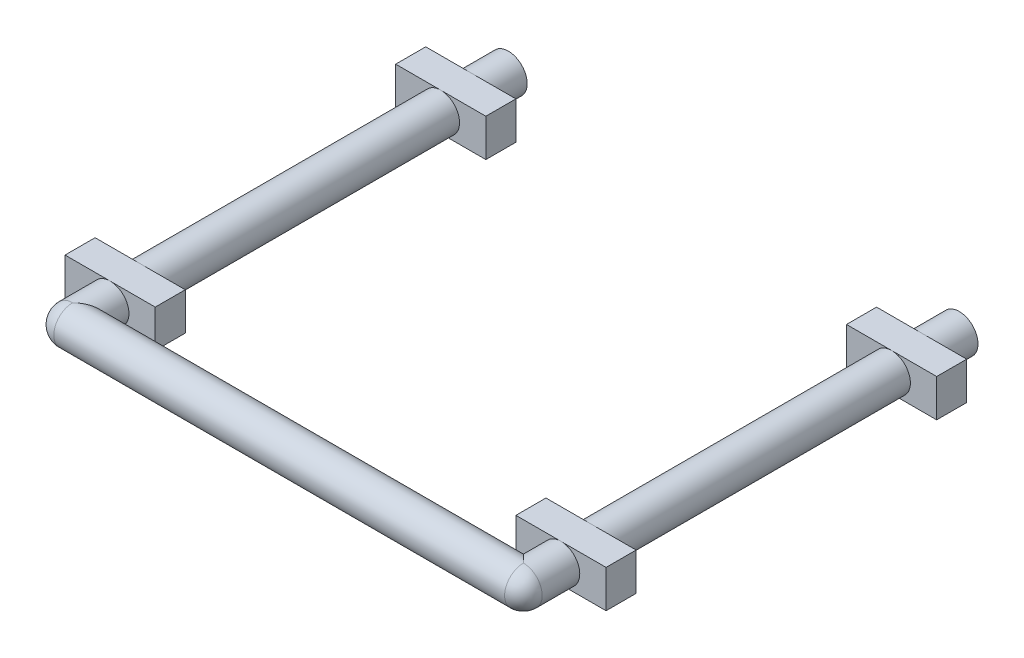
ISO-10303-21;
HEADER;
FILE_DESCRIPTION(('STEP AP214'),'2;1');
FILE_NAME('part.step','',(''),(''),'','','');
FILE_SCHEMA(('AUTOMOTIVE_DESIGN { 1 0 10303 214 1 1 1 1 }'));
ENDSEC;
DATA;
#1=APPLICATION_CONTEXT('core data for automotive mechanical design processes');
#2=APPLICATION_PROTOCOL_DEFINITION('international standard','automotive_design',2000,#1);
#3=PRODUCT_CONTEXT('',#1,'mechanical');
#4=PRODUCT('Part','Part','',(#3));
#5=PRODUCT_RELATED_PRODUCT_CATEGORY('part','',(#4));
#6=PRODUCT_DEFINITION_FORMATION('','',#4);
#7=PRODUCT_DEFINITION_CONTEXT('part definition',#1,'design');
#8=PRODUCT_DEFINITION('design','',#6,#7);
#9=PRODUCT_DEFINITION_SHAPE('','',#8);
#10=(LENGTH_UNIT() NAMED_UNIT(*) SI_UNIT(.MILLI.,.METRE.));
#11=(NAMED_UNIT(*) PLANE_ANGLE_UNIT() SI_UNIT($,.RADIAN.));
#12=(NAMED_UNIT(*) SI_UNIT($,.STERADIAN.) SOLID_ANGLE_UNIT());
#13=UNCERTAINTY_MEASURE_WITH_UNIT(LENGTH_MEASURE(1.E-05),#10,'distance_accuracy_value','');
#14=(GEOMETRIC_REPRESENTATION_CONTEXT(3) GLOBAL_UNCERTAINTY_ASSIGNED_CONTEXT((#13)) GLOBAL_UNIT_ASSIGNED_CONTEXT((#10,
#11,#12)) REPRESENTATION_CONTEXT('',''));
#15=CARTESIAN_POINT('',(0.,0.,0.));
#16=DIRECTION('',(0.,0.,1.));
#17=DIRECTION('',(1.,0.,0.));
#18=AXIS2_PLACEMENT_3D('',#15,#16,#17);
#19=CARTESIAN_POINT('',(-54.,2.49999999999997,5.));
#20=DIRECTION('',(0.,0.,1.));
#21=DIRECTION('',(-1.,0.,0.));
#22=AXIS2_PLACEMENT_3D('',#19,#20,#21);
#23=PLANE('',#22);
#24=CARTESIAN_POINT('',(-60.,0.,5.));
#25=DIRECTION('',(0.,0.,-1.));
#26=DIRECTION('',(-1.,0.,0.));
#27=AXIS2_PLACEMENT_3D('',#24,#25,#26);
#28=CIRCLE('',#27,2.5);
#29=CARTESIAN_POINT('',(-60.,2.5,5.));
#30=VERTEX_POINT('',#29);
#31=CARTESIAN_POINT('',(-60.,-2.5,5.));
#32=VERTEX_POINT('',#31);
#33=EDGE_CURVE('E43',#30,#32,#28,.T.);
#34=ORIENTED_EDGE('',*,*,#33,.F.);
#35=DIRECTION('',(1.,0.,0.));
#36=VECTOR('',#35,1.);
#37=CARTESIAN_POINT('',(-54.,2.49999999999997,5.));
#38=LINE('',#37,#36);
#39=CARTESIAN_POINT('',(-54.,2.49999999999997,5.));
#40=VERTEX_POINT('',#39);
#41=EDGE_CURVE('E211',#30,#40,#38,.T.);
#42=ORIENTED_EDGE('',*,*,#41,.T.);
#43=DIRECTION('',(0.,-1.,0.));
#44=VECTOR('',#43,1.);
#45=CARTESIAN_POINT('',(-54.,2.49999999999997,5.));
#46=LINE('',#45,#44);
#47=CARTESIAN_POINT('',(-54.,-2.49999999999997,5.));
#48=VERTEX_POINT('',#47);
#49=EDGE_CURVE('E221',#40,#48,#46,.T.);
#50=ORIENTED_EDGE('',*,*,#49,.T.);
#51=DIRECTION('',(-1.,0.,0.));
#52=VECTOR('',#51,1.);
#53=CARTESIAN_POINT('',(-54.,-2.49999999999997,5.));
#54=LINE('',#53,#52);
#55=EDGE_CURVE('E225',#48,#32,#54,.T.);
#56=ORIENTED_EDGE('',*,*,#55,.T.);
#57=EDGE_LOOP('',(#34,#42,#50,#56));
#58=FACE_BOUND('',#57,.T.);
#59=ADVANCED_FACE('F32',(#58),#23,.F.);
#60=EDGE_CURVE('E11',#32,#30,#28,.T.);
#61=ORIENTED_EDGE('',*,*,#60,.F.);
#62=CARTESIAN_POINT('',(-66.,-2.5,5.));
#63=VERTEX_POINT('',#62);
#64=EDGE_CURVE('E241',#32,#63,#54,.T.);
#65=ORIENTED_EDGE('',*,*,#64,.T.);
#66=DIRECTION('',(0.,1.,0.));
#67=VECTOR('',#66,1.);
#68=CARTESIAN_POINT('',(-66.0000000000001,2.5,5.));
#69=LINE('',#68,#67);
#70=CARTESIAN_POINT('',(-66.0000000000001,2.5,5.));
#71=VERTEX_POINT('',#70);
#72=EDGE_CURVE('E209',#63,#71,#69,.T.);
#73=ORIENTED_EDGE('',*,*,#72,.T.);
#74=EDGE_CURVE('E205',#71,#30,#38,.T.);
#75=ORIENTED_EDGE('',*,*,#74,.T.);
#76=EDGE_LOOP('',(#61,#65,#73,#75));
#77=FACE_BOUND('',#76,.T.);
#78=ADVANCED_FACE('F207',(#77),#23,.F.);
#79=CARTESIAN_POINT('',(-54.,-2.49999999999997,49.));
#80=DIRECTION('',(0.,0.,1.));
#81=DIRECTION('',(-1.,0.,0.));
#82=AXIS2_PLACEMENT_3D('',#79,#80,#81);
#83=PLANE('',#82);
#84=CARTESIAN_POINT('',(-60.,0.,49.));
#85=DIRECTION('',(0.,0.,-1.));
#86=DIRECTION('',(-1.,0.,0.));
#87=AXIS2_PLACEMENT_3D('',#84,#85,#86);
#88=CIRCLE('',#87,2.5);
#89=CARTESIAN_POINT('',(-60.,2.5,49.));
#90=VERTEX_POINT('',#89);
#91=CARTESIAN_POINT('',(-60.,-2.5,49.));
#92=VERTEX_POINT('',#91);
#93=EDGE_CURVE('E267',#90,#92,#88,.T.);
#94=ORIENTED_EDGE('',*,*,#93,.F.);
#95=DIRECTION('',(1.,0.,0.));
#96=VECTOR('',#95,1.);
#97=CARTESIAN_POINT('',(-54.,2.49999999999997,49.));
#98=LINE('',#97,#96);
#99=CARTESIAN_POINT('',(-54.,2.49999999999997,49.));
#100=VERTEX_POINT('',#99);
#101=EDGE_CURVE('E273',#90,#100,#98,.T.);
#102=ORIENTED_EDGE('',*,*,#101,.T.);
#103=DIRECTION('',(0.,-1.,0.));
#104=VECTOR('',#103,1.);
#105=CARTESIAN_POINT('',(-54.,2.49999999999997,49.));
#106=LINE('',#105,#104);
#107=CARTESIAN_POINT('',(-54.,-2.49999999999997,49.));
#108=VERTEX_POINT('',#107);
#109=EDGE_CURVE('E270',#100,#108,#106,.T.);
#110=ORIENTED_EDGE('',*,*,#109,.T.);
#111=DIRECTION('',(-1.,0.,0.));
#112=VECTOR('',#111,1.);
#113=CARTESIAN_POINT('',(-54.,-2.49999999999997,49.));
#114=LINE('',#113,#112);
#115=EDGE_CURVE('E280',#108,#92,#114,.T.);
#116=ORIENTED_EDGE('',*,*,#115,.T.);
#117=EDGE_LOOP('',(#94,#102,#110,#116));
#118=FACE_BOUND('',#117,.T.);
#119=ADVANCED_FACE('F469',(#118),#83,.F.);
#120=EDGE_CURVE('E41',#92,#90,#88,.T.);
#121=ORIENTED_EDGE('',*,*,#120,.F.);
#122=CARTESIAN_POINT('',(-66.,-2.5,49.));
#123=VERTEX_POINT('',#122);
#124=EDGE_CURVE('E279',#92,#123,#114,.T.);
#125=ORIENTED_EDGE('',*,*,#124,.T.);
#126=DIRECTION('',(0.,1.,0.));
#127=VECTOR('',#126,1.);
#128=CARTESIAN_POINT('',(-66.0000000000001,2.5,49.));
#129=LINE('',#128,#127);
#130=CARTESIAN_POINT('',(-66.0000000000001,2.5,49.));
#131=VERTEX_POINT('',#130);
#132=EDGE_CURVE('E276',#123,#131,#129,.T.);
#133=ORIENTED_EDGE('',*,*,#132,.T.);
#134=EDGE_CURVE('E274',#131,#90,#98,.T.);
#135=ORIENTED_EDGE('',*,*,#134,.T.);
#136=EDGE_LOOP('',(#121,#125,#133,#135));
#137=FACE_BOUND('',#136,.T.);
#138=ADVANCED_FACE('F496',(#137),#83,.F.);
#139=CARTESIAN_POINT('',(-5.99999999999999,-2.50000000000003,53.));
#140=DIRECTION('',(0.,0.,1.));
#141=DIRECTION('',(1.,0.,0.));
#142=AXIS2_PLACEMENT_3D('',#139,#140,#141);
#143=PLANE('',#142);
#144=CARTESIAN_POINT('',(0.,0.,53.));
#145=DIRECTION('',(0.,0.,1.));
#146=DIRECTION('',(1.,0.,0.));
#147=AXIS2_PLACEMENT_3D('',#144,#145,#146);
#148=CIRCLE('',#147,2.5);
#149=CARTESIAN_POINT('',(0.,2.5,53.));
#150=VERTEX_POINT('',#149);
#151=CARTESIAN_POINT('',(0.,-2.50000000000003,53.));
#152=VERTEX_POINT('',#151);
#153=EDGE_CURVE('E321',#150,#152,#148,.T.);
#154=ORIENTED_EDGE('',*,*,#153,.F.);
#155=DIRECTION('',(-1.,0.,0.));
#156=VECTOR('',#155,1.);
#157=CARTESIAN_POINT('',(-6.00000000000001,2.5,53.));
#158=LINE('',#157,#156);
#159=CARTESIAN_POINT('',(-6.00000000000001,2.5,53.));
#160=VERTEX_POINT('',#159);
#161=EDGE_CURVE('E350',#150,#160,#158,.T.);
#162=ORIENTED_EDGE('',*,*,#161,.T.);
#163=DIRECTION('',(0.,-1.,0.));
#164=VECTOR('',#163,1.);
#165=CARTESIAN_POINT('',(-6.00000000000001,2.5,53.));
#166=LINE('',#165,#164);
#167=CARTESIAN_POINT('',(-5.99999999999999,-2.50000000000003,53.));
#168=VERTEX_POINT('',#167);
#169=EDGE_CURVE('E341',#160,#168,#166,.T.);
#170=ORIENTED_EDGE('',*,*,#169,.T.);
#171=DIRECTION('',(1.,0.,0.));
#172=VECTOR('',#171,1.);
#173=CARTESIAN_POINT('',(-5.99999999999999,-2.50000000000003,53.));
#174=LINE('',#173,#172);
#175=EDGE_CURVE('E345',#168,#152,#174,.T.);
#176=ORIENTED_EDGE('',*,*,#175,.T.);
#177=EDGE_LOOP('',(#154,#162,#170,#176));
#178=FACE_BOUND('',#177,.T.);
#179=ADVANCED_FACE('F463',(#178),#143,.T.);
#180=CARTESIAN_POINT('',(-6.00000000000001,2.5,9.));
#181=DIRECTION('',(0.,0.,1.));
#182=DIRECTION('',(1.,0.,0.));
#183=AXIS2_PLACEMENT_3D('',#180,#181,#182);
#184=PLANE('',#183);
#185=CARTESIAN_POINT('',(0.,0.,9.));
#186=DIRECTION('',(0.,0.,1.));
#187=DIRECTION('',(1.,0.,0.));
#188=AXIS2_PLACEMENT_3D('',#185,#186,#187);
#189=CIRCLE('',#188,2.5);
#190=CARTESIAN_POINT('',(0.,2.5,9.));
#191=VERTEX_POINT('',#190);
#192=CARTESIAN_POINT('',(0.,-2.50000000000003,9.));
#193=VERTEX_POINT('',#192);
#194=EDGE_CURVE('E365',#191,#193,#189,.T.);
#195=ORIENTED_EDGE('',*,*,#194,.F.);
#196=DIRECTION('',(-1.,0.,0.));
#197=VECTOR('',#196,1.);
#198=CARTESIAN_POINT('',(-6.00000000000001,2.5,9.));
#199=LINE('',#198,#197);
#200=CARTESIAN_POINT('',(-6.00000000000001,2.5,9.));
#201=VERTEX_POINT('',#200);
#202=EDGE_CURVE('E395',#191,#201,#199,.T.);
#203=ORIENTED_EDGE('',*,*,#202,.T.);
#204=DIRECTION('',(0.,-1.,0.));
#205=VECTOR('',#204,1.);
#206=CARTESIAN_POINT('',(-6.00000000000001,2.5,9.));
#207=LINE('',#206,#205);
#208=CARTESIAN_POINT('',(-5.99999999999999,-2.50000000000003,9.));
#209=VERTEX_POINT('',#208);
#210=EDGE_CURVE('E386',#201,#209,#207,.T.);
#211=ORIENTED_EDGE('',*,*,#210,.T.);
#212=DIRECTION('',(1.,0.,0.));
#213=VECTOR('',#212,1.);
#214=CARTESIAN_POINT('',(-5.99999999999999,-2.50000000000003,9.));
#215=LINE('',#214,#213);
#216=EDGE_CURVE('E390',#209,#193,#215,.T.);
#217=ORIENTED_EDGE('',*,*,#216,.T.);
#218=EDGE_LOOP('',(#195,#203,#211,#217));
#219=FACE_BOUND('',#218,.T.);
#220=ADVANCED_FACE('F446',(#219),#184,.T.);
#221=CARTESIAN_POINT('',(0.,0.,5.));
#222=DIRECTION('',(0.,0.,-1.));
#223=DIRECTION('',(-1.,0.,0.));
#224=AXIS2_PLACEMENT_3D('',#221,#222,#223);
#225=CYLINDRICAL_SURFACE('',#224,2.5);
#226=CARTESIAN_POINT('',(0.,0.,5.));
#227=DIRECTION('',(0.,0.,1.));
#228=DIRECTION('',(1.,0.,0.));
#229=AXIS2_PLACEMENT_3D('',#226,#227,#228);
#230=CIRCLE('',#229,2.5);
#231=CARTESIAN_POINT('',(0.,2.5,5.));
#232=VERTEX_POINT('',#231);
#233=CARTESIAN_POINT('',(0.,-2.50000000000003,5.));
#234=VERTEX_POINT('',#233);
#235=EDGE_CURVE('E413',#232,#234,#230,.T.);
#236=ORIENTED_EDGE('',*,*,#235,.F.);
#237=EDGE_CURVE('E412',#234,#232,#230,.T.);
#238=ORIENTED_EDGE('',*,*,#237,.F.);
#239=EDGE_LOOP('',(#236,#238));
#240=FACE_BOUND('',#239,.T.);
#241=CARTESIAN_POINT('',(0.,0.,0.));
#242=DIRECTION('',(0.,0.,1.));
#243=DIRECTION('',(1.,0.,0.));
#244=AXIS2_PLACEMENT_3D('',#241,#242,#243);
#245=CIRCLE('',#244,2.5);
#246=CARTESIAN_POINT('',(2.5,0.,0.));
#247=VERTEX_POINT('',#246);
#248=EDGE_CURVE('E410',#247,#247,#245,.T.);
#249=ORIENTED_EDGE('',*,*,#248,.T.);
#250=EDGE_LOOP('',(#249));
#251=FACE_BOUND('',#250,.T.);
#252=ADVANCED_FACE('F34',(#240,#251),#225,.T.);
#253=CARTESIAN_POINT('',(0.,0.,0.));
#254=DIRECTION('',(0.,0.,1.));
#255=DIRECTION('',(1.,0.,0.));
#256=AXIS2_PLACEMENT_3D('',#253,#254,#255);
#257=PLANE('',#256);
#258=ORIENTED_EDGE('',*,*,#248,.F.);
#259=EDGE_LOOP('',(#258));
#260=FACE_BOUND('',#259,.T.);
#261=ADVANCED_FACE('F562',(#260),#257,.F.);
#262=CARTESIAN_POINT('',(-6.00000000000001,2.5,5.));
#263=DIRECTION('',(0.,0.,1.));
#264=DIRECTION('',(1.,0.,0.));
#265=AXIS2_PLACEMENT_3D('',#262,#263,#264);
#266=PLANE('',#265);
#267=DIRECTION('',(-1.,0.,0.));
#268=VECTOR('',#267,1.);
#269=CARTESIAN_POINT('',(-6.00000000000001,2.5,5.));
#270=LINE('',#269,#268);
#271=CARTESIAN_POINT('',(-6.00000000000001,2.5,5.));
#272=VERTEX_POINT('',#271);
#273=EDGE_CURVE('E382',#232,#272,#270,.T.);
#274=ORIENTED_EDGE('',*,*,#273,.F.);
#275=ORIENTED_EDGE('',*,*,#235,.T.);
#276=DIRECTION('',(1.,0.,0.));
#277=VECTOR('',#276,1.);
#278=CARTESIAN_POINT('',(-5.99999999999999,-2.50000000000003,5.));
#279=LINE('',#278,#277);
#280=CARTESIAN_POINT('',(-5.99999999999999,-2.50000000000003,5.));
#281=VERTEX_POINT('',#280);
#282=EDGE_CURVE('E377',#281,#234,#279,.T.);
#283=ORIENTED_EDGE('',*,*,#282,.F.);
#284=DIRECTION('',(0.,-1.,0.));
#285=VECTOR('',#284,1.);
#286=CARTESIAN_POINT('',(-6.00000000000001,2.5,5.));
#287=LINE('',#286,#285);
#288=EDGE_CURVE('E373',#272,#281,#287,.T.);
#289=ORIENTED_EDGE('',*,*,#288,.F.);
#290=EDGE_LOOP('',(#274,#275,#283,#289));
#291=FACE_BOUND('',#290,.T.);
#292=ADVANCED_FACE('F426',(#291),#266,.F.);
#293=CARTESIAN_POINT('',(6.,-2.5,5.));
#294=VERTEX_POINT('',#293);
#295=EDGE_CURVE('E376',#234,#294,#279,.T.);
#296=ORIENTED_EDGE('',*,*,#295,.F.);
#297=ORIENTED_EDGE('',*,*,#237,.T.);
#298=CARTESIAN_POINT('',(6.00000000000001,2.5,5.));
#299=VERTEX_POINT('',#298);
#300=EDGE_CURVE('E383',#299,#232,#270,.T.);
#301=ORIENTED_EDGE('',*,*,#300,.F.);
#302=DIRECTION('',(0.,1.,0.));
#303=VECTOR('',#302,1.);
#304=CARTESIAN_POINT('',(6.00000000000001,2.5,5.));
#305=LINE('',#304,#303);
#306=EDGE_CURVE('E380',#294,#299,#305,.T.);
#307=ORIENTED_EDGE('',*,*,#306,.F.);
#308=EDGE_LOOP('',(#296,#297,#301,#307));
#309=FACE_BOUND('',#308,.T.);
#310=ADVANCED_FACE('F422',(#309),#266,.F.);
#311=CARTESIAN_POINT('',(-6.00000000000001,2.5,9.));
#312=DIRECTION('',(1.,0.,0.));
#313=DIRECTION('',(0.,1.,0.));
#314=AXIS2_PLACEMENT_3D('',#311,#312,#313);
#315=PLANE('',#314);
#316=ORIENTED_EDGE('',*,*,#288,.T.);
#317=DIRECTION('',(0.,0.,-1.));
#318=VECTOR('',#317,1.);
#319=CARTESIAN_POINT('',(-5.99999999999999,-2.50000000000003,9.));
#320=LINE('',#319,#318);
#321=EDGE_CURVE('E407',#209,#281,#320,.T.);
#322=ORIENTED_EDGE('',*,*,#321,.F.);
#323=ORIENTED_EDGE('',*,*,#210,.F.);
#324=DIRECTION('',(0.,0.,-1.));
#325=VECTOR('',#324,1.);
#326=CARTESIAN_POINT('',(-6.00000000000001,2.5,9.));
#327=LINE('',#326,#325);
#328=EDGE_CURVE('E398',#201,#272,#327,.T.);
#329=ORIENTED_EDGE('',*,*,#328,.T.);
#330=EDGE_LOOP('',(#316,#322,#323,#329));
#331=FACE_BOUND('',#330,.T.);
#332=ADVANCED_FACE('F443',(#331),#315,.F.);
#333=CARTESIAN_POINT('',(-5.99999999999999,-2.50000000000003,9.));
#334=DIRECTION('',(0.,1.,0.));
#335=DIRECTION('',(-1.,0.,0.));
#336=AXIS2_PLACEMENT_3D('',#333,#334,#335);
#337=PLANE('',#336);
#338=ORIENTED_EDGE('',*,*,#282,.T.);
#339=ORIENTED_EDGE('',*,*,#295,.T.);
#340=DIRECTION('',(0.,0.,-1.));
#341=VECTOR('',#340,1.);
#342=CARTESIAN_POINT('',(6.,-2.5,9.));
#343=LINE('',#342,#341);
#344=CARTESIAN_POINT('',(6.,-2.5,9.));
#345=VERTEX_POINT('',#344);
#346=EDGE_CURVE('E404',#345,#294,#343,.T.);
#347=ORIENTED_EDGE('',*,*,#346,.F.);
#348=EDGE_CURVE('E389',#193,#345,#215,.T.);
#349=ORIENTED_EDGE('',*,*,#348,.F.);
#350=ORIENTED_EDGE('',*,*,#216,.F.);
#351=ORIENTED_EDGE('',*,*,#321,.T.);
#352=EDGE_LOOP('',(#338,#339,#347,#349,#350,#351));
#353=FACE_BOUND('',#352,.T.);
#354=ADVANCED_FACE('F439',(#353),#337,.F.);
#355=CARTESIAN_POINT('',(6.00000000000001,2.5,9.));
#356=DIRECTION('',(-1.,0.,0.));
#357=DIRECTION('',(0.,-1.,0.));
#358=AXIS2_PLACEMENT_3D('',#355,#356,#357);
#359=PLANE('',#358);
#360=ORIENTED_EDGE('',*,*,#306,.T.);
#361=DIRECTION('',(0.,0.,-1.));
#362=VECTOR('',#361,1.);
#363=CARTESIAN_POINT('',(6.00000000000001,2.5,9.));
#364=LINE('',#363,#362);
#365=CARTESIAN_POINT('',(6.00000000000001,2.5,9.));
#366=VERTEX_POINT('',#365);
#367=EDGE_CURVE('E401',#366,#299,#364,.T.);
#368=ORIENTED_EDGE('',*,*,#367,.F.);
#369=DIRECTION('',(0.,1.,0.));
#370=VECTOR('',#369,1.);
#371=CARTESIAN_POINT('',(6.00000000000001,2.5,9.));
#372=LINE('',#371,#370);
#373=EDGE_CURVE('E393',#345,#366,#372,.T.);
#374=ORIENTED_EDGE('',*,*,#373,.F.);
#375=ORIENTED_EDGE('',*,*,#346,.T.);
#376=EDGE_LOOP('',(#360,#368,#374,#375));
#377=FACE_BOUND('',#376,.T.);
#378=ADVANCED_FACE('F435',(#377),#359,.F.);
#379=CARTESIAN_POINT('',(-6.00000000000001,2.5,9.));
#380=DIRECTION('',(0.,-1.,0.));
#381=DIRECTION('',(0.,0.,-1.));
#382=AXIS2_PLACEMENT_3D('',#379,#380,#381);
#383=PLANE('',#382);
#384=ORIENTED_EDGE('',*,*,#300,.T.);
#385=ORIENTED_EDGE('',*,*,#273,.T.);
#386=ORIENTED_EDGE('',*,*,#328,.F.);
#387=ORIENTED_EDGE('',*,*,#202,.F.);
#388=EDGE_CURVE('E396',#366,#191,#199,.T.);
#389=ORIENTED_EDGE('',*,*,#388,.F.);
#390=ORIENTED_EDGE('',*,*,#367,.T.);
#391=EDGE_LOOP('',(#384,#385,#386,#387,#389,#390));
#392=FACE_BOUND('',#391,.T.);
#393=ADVANCED_FACE('F429',(#392),#383,.F.);
#394=EDGE_CURVE('E369',#193,#191,#189,.T.);
#395=ORIENTED_EDGE('',*,*,#394,.F.);
#396=ORIENTED_EDGE('',*,*,#348,.T.);
#397=ORIENTED_EDGE('',*,*,#373,.T.);
#398=ORIENTED_EDGE('',*,*,#388,.T.);
#399=EDGE_LOOP('',(#395,#396,#397,#398));
#400=FACE_BOUND('',#399,.T.);
#401=ADVANCED_FACE('F451',(#400),#184,.T.);
#402=CARTESIAN_POINT('',(0.,0.,49.));
#403=DIRECTION('',(0.,0.,-1.));
#404=DIRECTION('',(-1.,0.,0.));
#405=AXIS2_PLACEMENT_3D('',#402,#403,#404);
#406=CYLINDRICAL_SURFACE('',#405,2.5);
#407=ORIENTED_EDGE('',*,*,#194,.T.);
#408=ORIENTED_EDGE('',*,*,#394,.T.);
#409=EDGE_LOOP('',(#407,#408));
#410=FACE_BOUND('',#409,.T.);
#411=CARTESIAN_POINT('',(0.,0.,49.));
#412=DIRECTION('',(0.,0.,1.));
#413=DIRECTION('',(1.,0.,0.));
#414=AXIS2_PLACEMENT_3D('',#411,#412,#413);
#415=CIRCLE('',#414,2.5);
#416=CARTESIAN_POINT('',(0.,2.5,49.));
#417=VERTEX_POINT('',#416);
#418=CARTESIAN_POINT('',(0.,-2.50000000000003,49.));
#419=VERTEX_POINT('',#418);
#420=EDGE_CURVE('E370',#417,#419,#415,.T.);
#421=ORIENTED_EDGE('',*,*,#420,.F.);
#422=EDGE_CURVE('E368',#419,#417,#415,.T.);
#423=ORIENTED_EDGE('',*,*,#422,.F.);
#424=EDGE_LOOP('',(#421,#423));
#425=FACE_BOUND('',#424,.T.);
#426=ADVANCED_FACE('F448',(#410,#425),#406,.T.);
#427=CARTESIAN_POINT('',(-5.99999999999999,-2.50000000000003,49.));
#428=DIRECTION('',(0.,0.,1.));
#429=DIRECTION('',(1.,0.,0.));
#430=AXIS2_PLACEMENT_3D('',#427,#428,#429);
#431=PLANE('',#430);
#432=DIRECTION('',(-1.,0.,0.));
#433=VECTOR('',#432,1.);
#434=CARTESIAN_POINT('',(-6.00000000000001,2.5,49.));
#435=LINE('',#434,#433);
#436=CARTESIAN_POINT('',(-6.00000000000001,2.5,49.));
#437=VERTEX_POINT('',#436);
#438=EDGE_CURVE('E337',#417,#437,#435,.T.);
#439=ORIENTED_EDGE('',*,*,#438,.F.);
#440=ORIENTED_EDGE('',*,*,#420,.T.);
#441=DIRECTION('',(1.,0.,0.));
#442=VECTOR('',#441,1.);
#443=CARTESIAN_POINT('',(-5.99999999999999,-2.50000000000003,49.));
#444=LINE('',#443,#442);
#445=CARTESIAN_POINT('',(-5.99999999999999,-2.50000000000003,49.));
#446=VERTEX_POINT('',#445);
#447=EDGE_CURVE('E332',#446,#419,#444,.T.);
#448=ORIENTED_EDGE('',*,*,#447,.F.);
#449=DIRECTION('',(0.,-1.,0.));
#450=VECTOR('',#449,1.);
#451=CARTESIAN_POINT('',(-6.00000000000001,2.5,49.));
#452=LINE('',#451,#450);
#453=EDGE_CURVE('E328',#437,#446,#452,.T.);
#454=ORIENTED_EDGE('',*,*,#453,.F.);
#455=EDGE_LOOP('',(#439,#440,#448,#454));
#456=FACE_BOUND('',#455,.T.);
#457=ADVANCED_FACE('F458',(#456),#431,.F.);
#458=CARTESIAN_POINT('',(6.,-2.5,49.));
#459=VERTEX_POINT('',#458);
#460=EDGE_CURVE('E331',#419,#459,#444,.T.);
#461=ORIENTED_EDGE('',*,*,#460,.F.);
#462=ORIENTED_EDGE('',*,*,#422,.T.);
#463=CARTESIAN_POINT('',(6.00000000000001,2.5,49.));
#464=VERTEX_POINT('',#463);
#465=EDGE_CURVE('E338',#464,#417,#435,.T.);
#466=ORIENTED_EDGE('',*,*,#465,.F.);
#467=DIRECTION('',(0.,1.,0.));
#468=VECTOR('',#467,1.);
#469=CARTESIAN_POINT('',(6.00000000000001,2.5,49.));
#470=LINE('',#469,#468);
#471=EDGE_CURVE('E335',#459,#464,#470,.T.);
#472=ORIENTED_EDGE('',*,*,#471,.F.);
#473=EDGE_LOOP('',(#461,#462,#466,#472));
#474=FACE_BOUND('',#473,.T.);
#475=ADVANCED_FACE('F541',(#474),#431,.F.);
#476=CARTESIAN_POINT('',(-6.00000000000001,2.5,53.));
#477=DIRECTION('',(1.,0.,0.));
#478=DIRECTION('',(0.,0.,-1.));
#479=AXIS2_PLACEMENT_3D('',#476,#477,#478);
#480=PLANE('',#479);
#481=ORIENTED_EDGE('',*,*,#453,.T.);
#482=DIRECTION('',(0.,0.,-1.));
#483=VECTOR('',#482,1.);
#484=CARTESIAN_POINT('',(-5.99999999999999,-2.50000000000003,53.));
#485=LINE('',#484,#483);
#486=EDGE_CURVE('E362',#168,#446,#485,.T.);
#487=ORIENTED_EDGE('',*,*,#486,.F.);
#488=ORIENTED_EDGE('',*,*,#169,.F.);
#489=DIRECTION('',(0.,0.,-1.));
#490=VECTOR('',#489,1.);
#491=CARTESIAN_POINT('',(-6.00000000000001,2.5,53.));
#492=LINE('',#491,#490);
#493=EDGE_CURVE('E353',#160,#437,#492,.T.);
#494=ORIENTED_EDGE('',*,*,#493,.T.);
#495=EDGE_LOOP('',(#481,#487,#488,#494));
#496=FACE_BOUND('',#495,.T.);
#497=ADVANCED_FACE('F557',(#496),#480,.F.);
#498=CARTESIAN_POINT('',(-5.99999999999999,-2.50000000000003,53.));
#499=DIRECTION('',(0.,1.,0.));
#500=DIRECTION('',(0.,0.,1.));
#501=AXIS2_PLACEMENT_3D('',#498,#499,#500);
#502=PLANE('',#501);
#503=ORIENTED_EDGE('',*,*,#447,.T.);
#504=ORIENTED_EDGE('',*,*,#460,.T.);
#505=DIRECTION('',(0.,0.,-1.));
#506=VECTOR('',#505,1.);
#507=CARTESIAN_POINT('',(6.,-2.5,53.));
#508=LINE('',#507,#506);
#509=CARTESIAN_POINT('',(6.,-2.5,53.));
#510=VERTEX_POINT('',#509);
#511=EDGE_CURVE('E359',#510,#459,#508,.T.);
#512=ORIENTED_EDGE('',*,*,#511,.F.);
#513=EDGE_CURVE('E344',#152,#510,#174,.T.);
#514=ORIENTED_EDGE('',*,*,#513,.F.);
#515=ORIENTED_EDGE('',*,*,#175,.F.);
#516=ORIENTED_EDGE('',*,*,#486,.T.);
#517=EDGE_LOOP('',(#503,#504,#512,#514,#515,#516));
#518=FACE_BOUND('',#517,.T.);
#519=ADVANCED_FACE('F553',(#518),#502,.F.);
#520=CARTESIAN_POINT('',(6.00000000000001,2.5,53.));
#521=DIRECTION('',(-1.,0.,0.));
#522=DIRECTION('',(0.,0.,1.));
#523=AXIS2_PLACEMENT_3D('',#520,#521,#522);
#524=PLANE('',#523);
#525=ORIENTED_EDGE('',*,*,#471,.T.);
#526=DIRECTION('',(0.,0.,-1.));
#527=VECTOR('',#526,1.);
#528=CARTESIAN_POINT('',(6.00000000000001,2.5,53.));
#529=LINE('',#528,#527);
#530=CARTESIAN_POINT('',(6.00000000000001,2.5,53.));
#531=VERTEX_POINT('',#530);
#532=EDGE_CURVE('E356',#531,#464,#529,.T.);
#533=ORIENTED_EDGE('',*,*,#532,.F.);
#534=DIRECTION('',(0.,1.,0.));
#535=VECTOR('',#534,1.);
#536=CARTESIAN_POINT('',(6.00000000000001,2.5,53.));
#537=LINE('',#536,#535);
#538=EDGE_CURVE('E348',#510,#531,#537,.T.);
#539=ORIENTED_EDGE('',*,*,#538,.F.);
#540=ORIENTED_EDGE('',*,*,#511,.T.);
#541=EDGE_LOOP('',(#525,#533,#539,#540));
#542=FACE_BOUND('',#541,.T.);
#543=ADVANCED_FACE('F549',(#542),#524,.F.);
#544=CARTESIAN_POINT('',(-6.00000000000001,2.5,53.));
#545=DIRECTION('',(0.,-1.,0.));
#546=DIRECTION('',(0.,0.,-1.));
#547=AXIS2_PLACEMENT_3D('',#544,#545,#546);
#548=PLANE('',#547);
#549=ORIENTED_EDGE('',*,*,#465,.T.);
#550=ORIENTED_EDGE('',*,*,#438,.T.);
#551=ORIENTED_EDGE('',*,*,#493,.F.);
#552=ORIENTED_EDGE('',*,*,#161,.F.);
#553=EDGE_CURVE('E351',#531,#150,#158,.T.);
#554=ORIENTED_EDGE('',*,*,#553,.F.);
#555=ORIENTED_EDGE('',*,*,#532,.T.);
#556=EDGE_LOOP('',(#549,#550,#551,#552,#554,#555));
#557=FACE_BOUND('',#556,.T.);
#558=ADVANCED_FACE('F545',(#557),#548,.F.);
#559=EDGE_CURVE('E325',#152,#150,#148,.T.);
#560=ORIENTED_EDGE('',*,*,#559,.F.);
#561=ORIENTED_EDGE('',*,*,#513,.T.);
#562=ORIENTED_EDGE('',*,*,#538,.T.);
#563=ORIENTED_EDGE('',*,*,#553,.T.);
#564=EDGE_LOOP('',(#560,#561,#562,#563));
#565=FACE_BOUND('',#564,.T.);
#566=ADVANCED_FACE('F537',(#565),#143,.T.);
#567=CARTESIAN_POINT('',(0.,0.,58.));
#568=DIRECTION('',(0.,0.,-1.));
#569=DIRECTION('',(-1.,0.,0.));
#570=AXIS2_PLACEMENT_3D('',#567,#568,#569);
#571=CYLINDRICAL_SURFACE('',#570,2.5);
#572=ORIENTED_EDGE('',*,*,#153,.T.);
#573=ORIENTED_EDGE('',*,*,#559,.T.);
#574=EDGE_LOOP('',(#572,#573));
#575=FACE_BOUND('',#574,.T.);
#576=CARTESIAN_POINT('',(0.,0.,58.));
#577=DIRECTION('',(0.,0.,1.));
#578=DIRECTION('',(1.,0.,0.));
#579=AXIS2_PLACEMENT_3D('',#576,#577,#578);
#580=CIRCLE('',#579,2.5);
#581=CARTESIAN_POINT('',(0.,-2.50000000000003,58.));
#582=VERTEX_POINT('',#581);
#583=CARTESIAN_POINT('',(0.,2.5,58.));
#584=VERTEX_POINT('',#583);
#585=EDGE_CURVE('E324',#582,#584,#580,.T.);
#586=ORIENTED_EDGE('',*,*,#585,.F.);
#587=CARTESIAN_POINT('',(0.,0.,58.));
#588=DIRECTION('',(0.707106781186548,0.,-0.707106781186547));
#589=DIRECTION('',(-0.707106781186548,0.,-0.707106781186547));
#590=AXIS2_PLACEMENT_3D('',#587,#588,#589);
#591=ELLIPSE('',#590,3.53553390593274,2.5);
#592=EDGE_CURVE('E319',#582,#584,#591,.T.);
#593=ORIENTED_EDGE('',*,*,#592,.T.);
#594=EDGE_LOOP('',(#586,#593));
#595=FACE_BOUND('',#594,.T.);
#596=ADVANCED_FACE('F533',(#575,#595),#571,.T.);
#597=CARTESIAN_POINT('',(-30.,0.,58.));
#598=DIRECTION('',(1.,0.,0.));
#599=DIRECTION('',(0.,0.,-1.));
#600=AXIS2_PLACEMENT_3D('',#597,#598,#599);
#601=CYLINDRICAL_SURFACE('',#600,2.50000000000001);
#602=CARTESIAN_POINT('',(-60.,0.,58.));
#603=DIRECTION('',(0.707106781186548,0.,0.707106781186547));
#604=DIRECTION('',(0.707106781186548,0.,-0.707106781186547));
#605=AXIS2_PLACEMENT_3D('',#602,#603,#604);
#606=ELLIPSE('',#605,3.53553390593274,2.5);
#607=CARTESIAN_POINT('',(-60.,2.5,58.));
#608=VERTEX_POINT('',#607);
#609=CARTESIAN_POINT('',(-60.,-2.5,58.));
#610=VERTEX_POINT('',#609);
#611=EDGE_CURVE('E311',#608,#610,#606,.F.);
#612=ORIENTED_EDGE('',*,*,#611,.F.);
#613=CARTESIAN_POINT('',(-60.,0.,58.));
#614=DIRECTION('',(-1.,0.,0.));
#615=DIRECTION('',(0.,0.,1.));
#616=AXIS2_PLACEMENT_3D('',#613,#614,#615);
#617=CIRCLE('',#616,2.5);
#618=EDGE_CURVE('E313',#608,#610,#617,.F.);
#619=ORIENTED_EDGE('',*,*,#618,.T.);
#620=EDGE_LOOP('',(#612,#619));
#621=FACE_BOUND('',#620,.T.);
#622=ORIENTED_EDGE('',*,*,#592,.F.);
#623=CARTESIAN_POINT('',(0.,0.,58.));
#624=DIRECTION('',(1.,0.,0.));
#625=DIRECTION('',(0.,0.,-1.));
#626=AXIS2_PLACEMENT_3D('',#623,#624,#625);
#627=CIRCLE('',#626,2.50000000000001);
#628=EDGE_CURVE('E316',#584,#582,#627,.T.);
#629=ORIENTED_EDGE('',*,*,#628,.F.);
#630=EDGE_LOOP('',(#622,#629));
#631=FACE_BOUND('',#630,.T.);
#632=ADVANCED_FACE('F529',(#621,#631),#601,.T.);
#633=CARTESIAN_POINT('',(0.,0.,58.));
#634=DIRECTION('',(0.,1.,0.));
#635=DIRECTION('',(1.,0.,0.));
#636=AXIS2_PLACEMENT_3D('',#633,#634,#635);
#637=SPHERICAL_SURFACE('',#636,2.5);
#638=ORIENTED_EDGE('',*,*,#585,.T.);
#639=ORIENTED_EDGE('',*,*,#628,.T.);
#640=EDGE_LOOP('',(#638,#639));
#641=FACE_BOUND('',#640,.T.);
#642=ADVANCED_FACE('F525',(#641),#637,.T.);
#643=CARTESIAN_POINT('',(-60.,0.,58.));
#644=DIRECTION('',(0.,1.,0.));
#645=DIRECTION('',(-1.,0.,0.));
#646=AXIS2_PLACEMENT_3D('',#643,#644,#645);
#647=SPHERICAL_SURFACE('',#646,2.5);
#648=ORIENTED_EDGE('',*,*,#618,.F.);
#649=CARTESIAN_POINT('',(-60.,0.,58.));
#650=DIRECTION('',(0.,0.,1.));
#651=DIRECTION('',(1.,0.,0.));
#652=AXIS2_PLACEMENT_3D('',#649,#650,#651);
#653=CIRCLE('',#652,2.5);
#654=EDGE_CURVE('E36',#608,#610,#653,.T.);
#655=ORIENTED_EDGE('',*,*,#654,.T.);
#656=EDGE_LOOP('',(#648,#655));
#657=FACE_BOUND('',#656,.T.);
#658=ADVANCED_FACE('F521',(#657),#647,.T.);
#659=CARTESIAN_POINT('',(-60.,0.,58.));
#660=DIRECTION('',(0.,0.,-1.));
#661=DIRECTION('',(-1.,0.,0.));
#662=AXIS2_PLACEMENT_3D('',#659,#660,#661);
#663=CYLINDRICAL_SURFACE('',#662,2.5);
#664=CARTESIAN_POINT('',(-60.,0.,53.));
#665=DIRECTION('',(0.,0.,-1.));
#666=DIRECTION('',(-1.,0.,0.));
#667=AXIS2_PLACEMENT_3D('',#664,#665,#666);
#668=CIRCLE('',#667,2.5);
#669=CARTESIAN_POINT('',(-60.,2.5,53.));
#670=VERTEX_POINT('',#669);
#671=CARTESIAN_POINT('',(-60.,-2.5,53.));
#672=VERTEX_POINT('',#671);
#673=EDGE_CURVE('E308',#670,#672,#668,.T.);
#674=ORIENTED_EDGE('',*,*,#673,.F.);
#675=EDGE_CURVE('E307',#672,#670,#668,.T.);
#676=ORIENTED_EDGE('',*,*,#675,.F.);
#677=EDGE_LOOP('',(#674,#676));
#678=FACE_BOUND('',#677,.T.);
#679=ORIENTED_EDGE('',*,*,#654,.F.);
#680=ORIENTED_EDGE('',*,*,#611,.T.);
#681=EDGE_LOOP('',(#679,#680));
#682=FACE_BOUND('',#681,.T.);
#683=ADVANCED_FACE('F518',(#678,#682),#663,.T.);
#684=CARTESIAN_POINT('',(-54.,-2.49999999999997,53.));
#685=DIRECTION('',(0.,0.,1.));
#686=DIRECTION('',(-1.,0.,0.));
#687=AXIS2_PLACEMENT_3D('',#684,#685,#686);
#688=PLANE('',#687);
#689=DIRECTION('',(1.,0.,0.));
#690=VECTOR('',#689,1.);
#691=CARTESIAN_POINT('',(-54.,2.49999999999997,53.));
#692=LINE('',#691,#690);
#693=CARTESIAN_POINT('',(-54.,2.49999999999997,53.));
#694=VERTEX_POINT('',#693);
#695=EDGE_CURVE('E286',#670,#694,#692,.T.);
#696=ORIENTED_EDGE('',*,*,#695,.F.);
#697=ORIENTED_EDGE('',*,*,#673,.T.);
#698=DIRECTION('',(-1.,0.,0.));
#699=VECTOR('',#698,1.);
#700=CARTESIAN_POINT('',(-54.,-2.49999999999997,53.));
#701=LINE('',#700,#699);
#702=CARTESIAN_POINT('',(-54.,-2.49999999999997,53.));
#703=VERTEX_POINT('',#702);
#704=EDGE_CURVE('E294',#703,#672,#701,.T.);
#705=ORIENTED_EDGE('',*,*,#704,.F.);
#706=DIRECTION('',(0.,-1.,0.));
#707=VECTOR('',#706,1.);
#708=CARTESIAN_POINT('',(-54.,2.49999999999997,53.));
#709=LINE('',#708,#707);
#710=EDGE_CURVE('E283',#694,#703,#709,.T.);
#711=ORIENTED_EDGE('',*,*,#710,.F.);
#712=EDGE_LOOP('',(#696,#697,#705,#711));
#713=FACE_BOUND('',#712,.T.);
#714=ADVANCED_FACE('F502',(#713),#688,.T.);
#715=CARTESIAN_POINT('',(-54.,2.49999999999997,53.));
#716=DIRECTION('',(1.,0.,0.));
#717=DIRECTION('',(0.,0.,-1.));
#718=AXIS2_PLACEMENT_3D('',#715,#716,#717);
#719=PLANE('',#718);
#720=ORIENTED_EDGE('',*,*,#109,.F.);
#721=DIRECTION('',(0.,0.,-1.));
#722=VECTOR('',#721,1.);
#723=CARTESIAN_POINT('',(-54.,2.49999999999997,53.));
#724=LINE('',#723,#722);
#725=EDGE_CURVE('E304',#694,#100,#724,.T.);
#726=ORIENTED_EDGE('',*,*,#725,.F.);
#727=ORIENTED_EDGE('',*,*,#710,.T.);
#728=DIRECTION('',(0.,0.,-1.));
#729=VECTOR('',#728,1.);
#730=CARTESIAN_POINT('',(-54.,-2.49999999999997,53.));
#731=LINE('',#730,#729);
#732=EDGE_CURVE('E297',#703,#108,#731,.T.);
#733=ORIENTED_EDGE('',*,*,#732,.T.);
#734=EDGE_LOOP('',(#720,#726,#727,#733));
#735=FACE_BOUND('',#734,.T.);
#736=ADVANCED_FACE('F513',(#735),#719,.T.);
#737=CARTESIAN_POINT('',(-54.,2.49999999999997,53.));
#738=DIRECTION('',(0.,1.,0.));
#739=DIRECTION('',(0.,0.,1.));
#740=AXIS2_PLACEMENT_3D('',#737,#738,#739);
#741=PLANE('',#740);
#742=ORIENTED_EDGE('',*,*,#134,.F.);
#743=DIRECTION('',(0.,0.,-1.));
#744=VECTOR('',#743,1.);
#745=CARTESIAN_POINT('',(-66.0000000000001,2.5,53.));
#746=LINE('',#745,#744);
#747=CARTESIAN_POINT('',(-66.0000000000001,2.5,53.));
#748=VERTEX_POINT('',#747);
#749=EDGE_CURVE('E302',#748,#131,#746,.T.);
#750=ORIENTED_EDGE('',*,*,#749,.F.);
#751=EDGE_CURVE('E287',#748,#670,#692,.T.);
#752=ORIENTED_EDGE('',*,*,#751,.T.);
#753=ORIENTED_EDGE('',*,*,#695,.T.);
#754=ORIENTED_EDGE('',*,*,#725,.T.);
#755=ORIENTED_EDGE('',*,*,#101,.F.);
#756=EDGE_LOOP('',(#742,#750,#752,#753,#754,#755));
#757=FACE_BOUND('',#756,.T.);
#758=ADVANCED_FACE('F509',(#757),#741,.T.);
#759=CARTESIAN_POINT('',(-66.0000000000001,2.5,53.));
#760=DIRECTION('',(-1.,0.,0.));
#761=DIRECTION('',(0.,0.,1.));
#762=AXIS2_PLACEMENT_3D('',#759,#760,#761);
#763=PLANE('',#762);
#764=ORIENTED_EDGE('',*,*,#132,.F.);
#765=DIRECTION('',(0.,0.,-1.));
#766=VECTOR('',#765,1.);
#767=CARTESIAN_POINT('',(-66.,-2.5,53.));
#768=LINE('',#767,#766);
#769=CARTESIAN_POINT('',(-66.,-2.5,53.));
#770=VERTEX_POINT('',#769);
#771=EDGE_CURVE('E299',#770,#123,#768,.T.);
#772=ORIENTED_EDGE('',*,*,#771,.F.);
#773=DIRECTION('',(0.,1.,0.));
#774=VECTOR('',#773,1.);
#775=CARTESIAN_POINT('',(-66.0000000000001,2.5,53.));
#776=LINE('',#775,#774);
#777=EDGE_CURVE('E290',#770,#748,#776,.T.);
#778=ORIENTED_EDGE('',*,*,#777,.T.);
#779=ORIENTED_EDGE('',*,*,#749,.T.);
#780=EDGE_LOOP('',(#764,#772,#778,#779));
#781=FACE_BOUND('',#780,.T.);
#782=ADVANCED_FACE('F505',(#781),#763,.T.);
#783=CARTESIAN_POINT('',(-54.,-2.49999999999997,53.));
#784=DIRECTION('',(0.,-1.,0.));
#785=DIRECTION('',(0.,0.,-1.));
#786=AXIS2_PLACEMENT_3D('',#783,#784,#785);
#787=PLANE('',#786);
#788=ORIENTED_EDGE('',*,*,#115,.F.);
#789=ORIENTED_EDGE('',*,*,#732,.F.);
#790=ORIENTED_EDGE('',*,*,#704,.T.);
#791=EDGE_CURVE('E293',#672,#770,#701,.T.);
#792=ORIENTED_EDGE('',*,*,#791,.T.);
#793=ORIENTED_EDGE('',*,*,#771,.T.);
#794=ORIENTED_EDGE('',*,*,#124,.F.);
#795=EDGE_LOOP('',(#788,#789,#790,#792,#793,#794));
#796=FACE_BOUND('',#795,.T.);
#797=ADVANCED_FACE('F500',(#796),#787,.T.);
#798=ORIENTED_EDGE('',*,*,#791,.F.);
#799=ORIENTED_EDGE('',*,*,#675,.T.);
#800=ORIENTED_EDGE('',*,*,#751,.F.);
#801=ORIENTED_EDGE('',*,*,#777,.F.);
#802=EDGE_LOOP('',(#798,#799,#800,#801));
#803=FACE_BOUND('',#802,.T.);
#804=ADVANCED_FACE('F493',(#803),#688,.T.);
#805=CARTESIAN_POINT('',(-60.,0.,49.));
#806=DIRECTION('',(0.,0.,-1.));
#807=DIRECTION('',(-1.,0.,0.));
#808=AXIS2_PLACEMENT_3D('',#805,#806,#807);
#809=CYLINDRICAL_SURFACE('',#808,2.5);
#810=CARTESIAN_POINT('',(-60.,0.,9.));
#811=DIRECTION('',(0.,0.,-1.));
#812=DIRECTION('',(-1.,0.,0.));
#813=AXIS2_PLACEMENT_3D('',#810,#811,#812);
#814=CIRCLE('',#813,2.5);
#815=CARTESIAN_POINT('',(-60.,2.5,9.));
#816=VERTEX_POINT('',#815);
#817=CARTESIAN_POINT('',(-60.,-2.5,9.));
#818=VERTEX_POINT('',#817);
#819=EDGE_CURVE('E265',#816,#818,#814,.T.);
#820=ORIENTED_EDGE('',*,*,#819,.F.);
#821=EDGE_CURVE('E55',#818,#816,#814,.T.);
#822=ORIENTED_EDGE('',*,*,#821,.F.);
#823=EDGE_LOOP('',(#820,#822));
#824=FACE_BOUND('',#823,.T.);
#825=ORIENTED_EDGE('',*,*,#93,.T.);
#826=ORIENTED_EDGE('',*,*,#120,.T.);
#827=EDGE_LOOP('',(#825,#826));
#828=FACE_BOUND('',#827,.T.);
#829=ADVANCED_FACE('F490',(#824,#828),#809,.T.);
#830=CARTESIAN_POINT('',(-54.,2.49999999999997,9.));
#831=DIRECTION('',(0.,0.,1.));
#832=DIRECTION('',(-1.,0.,0.));
#833=AXIS2_PLACEMENT_3D('',#830,#831,#832);
#834=PLANE('',#833);
#835=DIRECTION('',(1.,0.,0.));
#836=VECTOR('',#835,1.);
#837=CARTESIAN_POINT('',(-54.,2.49999999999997,9.));
#838=LINE('',#837,#836);
#839=CARTESIAN_POINT('',(-54.,2.49999999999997,9.));
#840=VERTEX_POINT('',#839);
#841=EDGE_CURVE('E246',#816,#840,#838,.T.);
#842=ORIENTED_EDGE('',*,*,#841,.F.);
#843=ORIENTED_EDGE('',*,*,#819,.T.);
#844=DIRECTION('',(-1.,0.,0.));
#845=VECTOR('',#844,1.);
#846=CARTESIAN_POINT('',(-54.,-2.49999999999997,9.));
#847=LINE('',#846,#845);
#848=CARTESIAN_POINT('',(-54.,-2.49999999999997,9.));
#849=VERTEX_POINT('',#848);
#850=EDGE_CURVE('E254',#849,#818,#847,.T.);
#851=ORIENTED_EDGE('',*,*,#850,.F.);
#852=DIRECTION('',(0.,-1.,0.));
#853=VECTOR('',#852,1.);
#854=CARTESIAN_POINT('',(-54.,2.49999999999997,9.));
#855=LINE('',#854,#853);
#856=EDGE_CURVE('E243',#840,#849,#855,.T.);
#857=ORIENTED_EDGE('',*,*,#856,.F.);
#858=EDGE_LOOP('',(#842,#843,#851,#857));
#859=FACE_BOUND('',#858,.T.);
#860=ADVANCED_FACE('F476',(#859),#834,.T.);
#861=CARTESIAN_POINT('',(-54.,2.49999999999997,9.));
#862=DIRECTION('',(1.,0.,0.));
#863=DIRECTION('',(0.,1.,0.));
#864=AXIS2_PLACEMENT_3D('',#861,#862,#863);
#865=PLANE('',#864);
#866=ORIENTED_EDGE('',*,*,#49,.F.);
#867=DIRECTION('',(0.,0.,-1.));
#868=VECTOR('',#867,1.);
#869=CARTESIAN_POINT('',(-54.,2.49999999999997,9.));
#870=LINE('',#869,#868);
#871=EDGE_CURVE('E217',#840,#40,#870,.T.);
#872=ORIENTED_EDGE('',*,*,#871,.F.);
#873=ORIENTED_EDGE('',*,*,#856,.T.);
#874=DIRECTION('',(0.,0.,-1.));
#875=VECTOR('',#874,1.);
#876=CARTESIAN_POINT('',(-54.,-2.49999999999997,9.));
#877=LINE('',#876,#875);
#878=EDGE_CURVE('E257',#849,#48,#877,.T.);
#879=ORIENTED_EDGE('',*,*,#878,.T.);
#880=EDGE_LOOP('',(#866,#872,#873,#879));
#881=FACE_BOUND('',#880,.T.);
#882=ADVANCED_FACE('F486',(#881),#865,.T.);
#883=CARTESIAN_POINT('',(-54.,2.49999999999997,9.));
#884=DIRECTION('',(0.,1.,0.));
#885=DIRECTION('',(0.,0.,1.));
#886=AXIS2_PLACEMENT_3D('',#883,#884,#885);
#887=PLANE('',#886);
#888=ORIENTED_EDGE('',*,*,#74,.F.);
#889=DIRECTION('',(0.,0.,-1.));
#890=VECTOR('',#889,1.);
#891=CARTESIAN_POINT('',(-66.0000000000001,2.5,9.));
#892=LINE('',#891,#890);
#893=CARTESIAN_POINT('',(-66.0000000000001,2.5,9.));
#894=VERTEX_POINT('',#893);
#895=EDGE_CURVE('E262',#894,#71,#892,.T.);
#896=ORIENTED_EDGE('',*,*,#895,.F.);
#897=EDGE_CURVE('E247',#894,#816,#838,.T.);
#898=ORIENTED_EDGE('',*,*,#897,.T.);
#899=ORIENTED_EDGE('',*,*,#841,.T.);
#900=ORIENTED_EDGE('',*,*,#871,.T.);
#901=ORIENTED_EDGE('',*,*,#41,.F.);
#902=EDGE_LOOP('',(#888,#896,#898,#899,#900,#901));
#903=FACE_BOUND('',#902,.T.);
#904=ADVANCED_FACE('F215',(#903),#887,.T.);
#905=CARTESIAN_POINT('',(-66.0000000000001,2.5,9.));
#906=DIRECTION('',(-1.,0.,0.));
#907=DIRECTION('',(0.,-1.,0.));
#908=AXIS2_PLACEMENT_3D('',#905,#906,#907);
#909=PLANE('',#908);
#910=ORIENTED_EDGE('',*,*,#72,.F.);
#911=DIRECTION('',(0.,0.,-1.));
#912=VECTOR('',#911,1.);
#913=CARTESIAN_POINT('',(-66.,-2.5,9.));
#914=LINE('',#913,#912);
#915=CARTESIAN_POINT('',(-66.,-2.5,9.));
#916=VERTEX_POINT('',#915);
#917=EDGE_CURVE('E259',#916,#63,#914,.T.);
#918=ORIENTED_EDGE('',*,*,#917,.F.);
#919=DIRECTION('',(0.,1.,0.));
#920=VECTOR('',#919,1.);
#921=CARTESIAN_POINT('',(-66.0000000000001,2.5,9.));
#922=LINE('',#921,#920);
#923=EDGE_CURVE('E250',#916,#894,#922,.T.);
#924=ORIENTED_EDGE('',*,*,#923,.T.);
#925=ORIENTED_EDGE('',*,*,#895,.T.);
#926=EDGE_LOOP('',(#910,#918,#924,#925));
#927=FACE_BOUND('',#926,.T.);
#928=ADVANCED_FACE('F479',(#927),#909,.T.);
#929=CARTESIAN_POINT('',(-54.,-2.49999999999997,9.));
#930=DIRECTION('',(0.,-1.,0.));
#931=DIRECTION('',(1.,0.,0.));
#932=AXIS2_PLACEMENT_3D('',#929,#930,#931);
#933=PLANE('',#932);
#934=ORIENTED_EDGE('',*,*,#55,.F.);
#935=ORIENTED_EDGE('',*,*,#878,.F.);
#936=ORIENTED_EDGE('',*,*,#850,.T.);
#937=EDGE_CURVE('E253',#818,#916,#847,.T.);
#938=ORIENTED_EDGE('',*,*,#937,.T.);
#939=ORIENTED_EDGE('',*,*,#917,.T.);
#940=ORIENTED_EDGE('',*,*,#64,.F.);
#941=EDGE_LOOP('',(#934,#935,#936,#938,#939,#940));
#942=FACE_BOUND('',#941,.T.);
#943=ADVANCED_FACE('F474',(#942),#933,.T.);
#944=ORIENTED_EDGE('',*,*,#937,.F.);
#945=ORIENTED_EDGE('',*,*,#821,.T.);
#946=ORIENTED_EDGE('',*,*,#897,.F.);
#947=ORIENTED_EDGE('',*,*,#923,.F.);
#948=EDGE_LOOP('',(#944,#945,#946,#947));
#949=FACE_BOUND('',#948,.T.);
#950=ADVANCED_FACE('F232',(#949),#834,.T.);
#951=CARTESIAN_POINT('',(-60.,0.,5.));
#952=DIRECTION('',(0.,0.,-1.));
#953=DIRECTION('',(-1.,0.,0.));
#954=AXIS2_PLACEMENT_3D('',#951,#952,#953);
#955=CYLINDRICAL_SURFACE('',#954,2.5);
#956=ORIENTED_EDGE('',*,*,#33,.T.);
#957=ORIENTED_EDGE('',*,*,#60,.T.);
#958=EDGE_LOOP('',(#956,#957));
#959=FACE_BOUND('',#958,.T.);
#960=CARTESIAN_POINT('',(-60.,0.,0.));
#961=DIRECTION('',(0.,0.,-1.));
#962=DIRECTION('',(-1.,0.,0.));
#963=AXIS2_PLACEMENT_3D('',#960,#961,#962);
#964=CIRCLE('',#963,2.5);
#965=CARTESIAN_POINT('',(-62.5,0.,0.));
#966=VERTEX_POINT('',#965);
#967=EDGE_CURVE('E227',#966,#966,#964,.T.);
#968=ORIENTED_EDGE('',*,*,#967,.F.);
#969=EDGE_LOOP('',(#968));
#970=FACE_BOUND('',#969,.T.);
#971=ADVANCED_FACE('F228',(#959,#970),#955,.T.);
#972=CARTESIAN_POINT('',(-60.,0.,0.));
#973=DIRECTION('',(0.,0.,1.));
#974=DIRECTION('',(-1.,0.,0.));
#975=AXIS2_PLACEMENT_3D('',#972,#973,#974);
#976=PLANE('',#975);
#977=ORIENTED_EDGE('',*,*,#967,.T.);
#978=EDGE_LOOP('',(#977));
#979=FACE_BOUND('',#978,.T.);
#980=ADVANCED_FACE('F231',(#979),#976,.F.);
#981=CLOSED_SHELL('',(#59,#78,#119,#138,#179,#220,#252,#261,#292,#310,#332,#354,#378,#393,#401,
#426,#457,#475,#497,#519,#543,#558,#566,#596,#632,#642,#658,#683,#714,#736,#758,#782,#797,#804,
#829,#860,#882,#904,#928,#943,#950,#971,#980));
#982=MANIFOLD_SOLID_BREP('B2',#981);
#983=ADVANCED_BREP_SHAPE_REPRESENTATION('',(#18,#982),#14);
#984=SHAPE_DEFINITION_REPRESENTATION(#9,#983);
ENDSEC;
END-ISO-10303-21;
